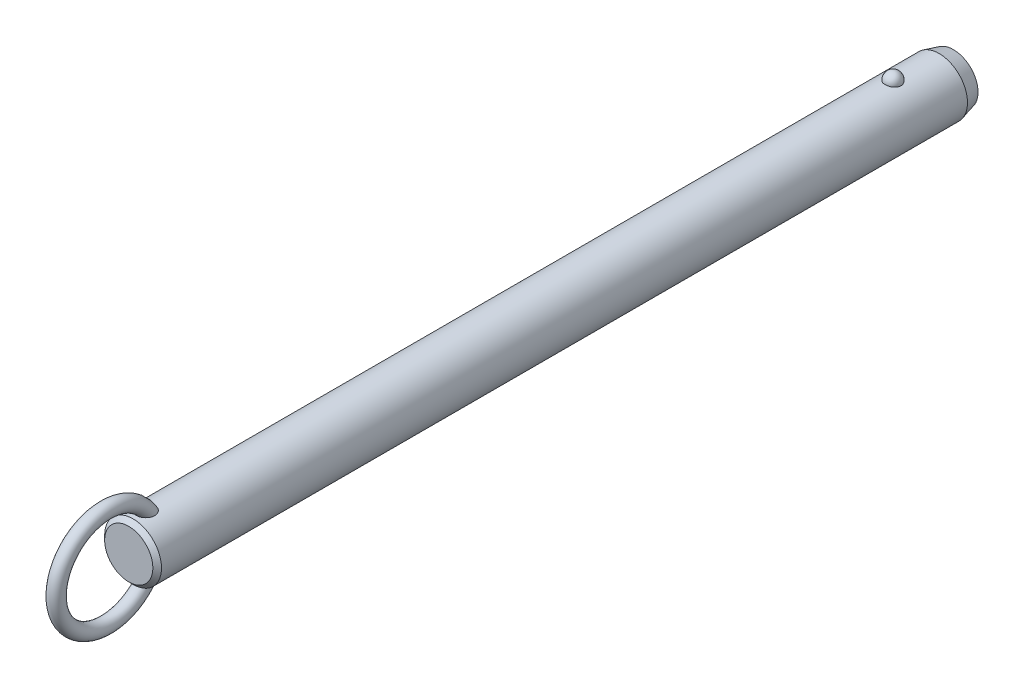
ISO-10303-21;
HEADER;
FILE_DESCRIPTION(('STEP AP214'),'2;1');
FILE_NAME('part.step','',(''),(''),'','','');
FILE_SCHEMA(('AUTOMOTIVE_DESIGN { 1 0 10303 214 1 1 1 1 }'));
ENDSEC;
DATA;
#1=APPLICATION_CONTEXT('core data for automotive mechanical design processes');
#2=APPLICATION_PROTOCOL_DEFINITION('international standard','automotive_design',2000,#1);
#3=PRODUCT_CONTEXT('',#1,'mechanical');
#4=PRODUCT('Part','Part','',(#3));
#5=PRODUCT_RELATED_PRODUCT_CATEGORY('part','',(#4));
#6=PRODUCT_DEFINITION_FORMATION('','',#4);
#7=PRODUCT_DEFINITION_CONTEXT('part definition',#1,'design');
#8=PRODUCT_DEFINITION('design','',#6,#7);
#9=PRODUCT_DEFINITION_SHAPE('','',#8);
#10=(LENGTH_UNIT() NAMED_UNIT(*) SI_UNIT(.MILLI.,.METRE.));
#11=(NAMED_UNIT(*) PLANE_ANGLE_UNIT() SI_UNIT($,.RADIAN.));
#12=(NAMED_UNIT(*) SI_UNIT($,.STERADIAN.) SOLID_ANGLE_UNIT());
#13=UNCERTAINTY_MEASURE_WITH_UNIT(LENGTH_MEASURE(1.E-05),#10,'distance_accuracy_value','');
#14=(GEOMETRIC_REPRESENTATION_CONTEXT(3) GLOBAL_UNCERTAINTY_ASSIGNED_CONTEXT((#13)) GLOBAL_UNIT_ASSIGNED_CONTEXT((#10,
#11,#12)) REPRESENTATION_CONTEXT('',''));
#15=CARTESIAN_POINT('',(0.,0.,0.));
#16=DIRECTION('',(0.,0.,1.));
#17=DIRECTION('',(1.,0.,0.));
#18=AXIS2_PLACEMENT_3D('',#15,#16,#17);
#19=CARTESIAN_POINT('',(0.,0.,200.7));
#20=DIRECTION('',(0.,0.,-1.));
#21=DIRECTION('',(-1.,0.,0.));
#22=AXIS2_PLACEMENT_3D('',#19,#20,#21);
#23=CYLINDRICAL_SURFACE('',#22,7.9);
#24=CARTESIAN_POINT('',(2.1785689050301,7.59367088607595,-2.20000000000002));
#25=CARTESIAN_POINT('',(2.17856679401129,7.59367269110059,-2.07701843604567));
#26=CARTESIAN_POINT('',(2.16853481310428,7.59657145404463,-1.95401006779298));
#27=CARTESIAN_POINT('',(2.12864689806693,7.607843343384,-1.71147811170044));
#28=CARTESIAN_POINT('',(2.09878338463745,7.61621856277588,-1.59195587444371));
#29=CARTESIAN_POINT('',(2.0199931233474,7.63749180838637,-1.35985638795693));
#30=CARTESIAN_POINT('',(1.97107475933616,7.65038784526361,-1.24727610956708));
#31=CARTESIAN_POINT('',(1.85539377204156,7.67926115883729,-1.03213234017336));
#32=CARTESIAN_POINT('',(1.78863158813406,7.69523835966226,-0.929568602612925));
#33=CARTESIAN_POINT('',(1.63856494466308,7.7285848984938,-0.736786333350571));
#34=CARTESIAN_POINT('',(1.55518140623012,7.7459606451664,-0.646630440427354));
#35=CARTESIAN_POINT('',(1.37422937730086,7.78009978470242,-0.481747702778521));
#36=CARTESIAN_POINT('',(1.27666086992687,7.79686317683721,-0.407020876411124));
#37=CARTESIAN_POINT('',(1.07024728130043,7.82786153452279,-0.275278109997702));
#38=CARTESIAN_POINT('',(0.961434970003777,7.84210353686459,-0.218212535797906));
#39=CARTESIAN_POINT('',(0.735351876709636,7.86652194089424,-0.123146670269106));
#40=CARTESIAN_POINT('',(0.618082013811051,7.87669878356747,-0.0851443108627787));
#41=CARTESIAN_POINT('',(0.380637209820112,7.89170521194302,-0.0298158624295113));
#42=CARTESIAN_POINT('',(0.260550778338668,7.89662650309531,-0.0121347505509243));
#43=CARTESIAN_POINT('',(0.019011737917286,7.90090003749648,0.00324379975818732));
#44=CARTESIAN_POINT('',(-0.10244074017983,7.90025280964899,0.000943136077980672));
#45=CARTESIAN_POINT('',(-0.341452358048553,7.89351056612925,-0.0233955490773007));
#46=CARTESIAN_POINT('',(-0.459042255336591,7.88749257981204,-0.0451545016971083));
#47=CARTESIAN_POINT('',(-0.688796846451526,7.87075812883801,-0.107408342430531));
#48=CARTESIAN_POINT('',(-0.800961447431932,7.86004158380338,-0.14790355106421));
#49=CARTESIAN_POINT('',(-1.01743634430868,7.83497131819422,-0.246799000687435));
#50=CARTESIAN_POINT('',(-1.12169791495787,7.82059709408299,-0.305300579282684));
#51=CARTESIAN_POINT('',(-1.31891765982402,7.78976470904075,-0.438549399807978));
#52=CARTESIAN_POINT('',(-1.41187469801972,7.77330633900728,-0.513298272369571));
#53=CARTESIAN_POINT('',(-1.58577142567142,7.73972434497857,-0.678622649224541));
#54=CARTESIAN_POINT('',(-1.66645140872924,7.72259402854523,-0.769470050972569));
#55=CARTESIAN_POINT('',(-1.81161503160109,7.68983776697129,-0.963538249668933));
#56=CARTESIAN_POINT('',(-1.87609753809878,7.6742119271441,-1.0667599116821));
#57=CARTESIAN_POINT('',(-1.98790138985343,7.6460202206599,-1.28401170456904));
#58=CARTESIAN_POINT('',(-2.03501994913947,7.63349104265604,-1.39815107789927));
#59=CARTESIAN_POINT('',(-2.10986724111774,7.6131449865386,-1.6330178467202));
#60=CARTESIAN_POINT('',(-2.1375965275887,7.60532797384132,-1.75374505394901));
#61=CARTESIAN_POINT('',(-2.17289256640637,7.5953195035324,-1.99782562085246));
#62=CARTESIAN_POINT('',(-2.18054294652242,7.59310471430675,-2.12116592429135));
#63=CARTESIAN_POINT('',(-2.17572919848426,7.59448538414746,-2.36741799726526));
#64=CARTESIAN_POINT('',(-2.1632656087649,7.59808068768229,-2.49032977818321));
#65=CARTESIAN_POINT('',(-2.11865035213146,7.61064035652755,-2.73161015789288));
#66=CARTESIAN_POINT('',(-2.08659579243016,7.61957823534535,-2.84999812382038));
#67=CARTESIAN_POINT('',(-2.00367799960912,7.64179982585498,-3.07955956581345));
#68=CARTESIAN_POINT('',(-1.9528140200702,7.65508371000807,-3.19073275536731));
#69=CARTESIAN_POINT('',(-1.83321113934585,7.68460381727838,-3.40337899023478));
#70=CARTESIAN_POINT('',(-1.76437735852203,7.70085556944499,-3.5047965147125));
#71=CARTESIAN_POINT('',(-1.61069526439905,7.73445734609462,-3.69446912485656));
#72=CARTESIAN_POINT('',(-1.52584634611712,7.75180741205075,-3.78272371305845));
#73=CARTESIAN_POINT('',(-1.34198059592,7.78574608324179,-3.94393987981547));
#74=CARTESIAN_POINT('',(-1.24291308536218,7.80233167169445,-4.01684434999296));
#75=CARTESIAN_POINT('',(-1.03352039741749,7.83281625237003,-4.14489386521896));
#76=CARTESIAN_POINT('',(-0.923196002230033,7.84671543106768,-4.20004014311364));
#77=CARTESIAN_POINT('',(-0.69582211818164,7.87011575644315,-4.29042017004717));
#78=CARTESIAN_POINT('',(-0.578872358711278,7.87966903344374,-4.32589112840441));
#79=CARTESIAN_POINT('',(-0.34041023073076,7.8935652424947,-4.37692226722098));
#80=CARTESIAN_POINT('',(-0.218898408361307,7.89790879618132,-4.39248482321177));
#81=CARTESIAN_POINT('',(0.0228107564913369,7.90087453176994,-4.40314405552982));
#82=CARTESIAN_POINT('',(0.142990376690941,7.89960185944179,-4.39861683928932));
#83=CARTESIAN_POINT('',(0.380829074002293,7.89171262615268,-4.37008293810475));
#84=CARTESIAN_POINT('',(0.498488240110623,7.8850962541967,-4.34607694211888));
#85=CARTESIAN_POINT('',(0.727535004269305,7.86726442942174,-4.27939317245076));
#86=CARTESIAN_POINT('',(0.838944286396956,7.85606616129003,-4.23678512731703));
#87=CARTESIAN_POINT('',(1.05295421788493,7.83025654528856,-4.13408348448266));
#88=CARTESIAN_POINT('',(1.15555431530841,7.81564498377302,-4.07398879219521));
#89=CARTESIAN_POINT('',(1.35076763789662,7.7843022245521,-3.93687432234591));
#90=CARTESIAN_POINT('',(1.4432046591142,7.76754209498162,-3.85961036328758));
#91=CARTESIAN_POINT('',(1.6139111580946,7.73387857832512,-3.69076949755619));
#92=CARTESIAN_POINT('',(1.6921781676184,7.71697516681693,-3.59919010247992));
#93=CARTESIAN_POINT('',(1.83380875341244,7.6845643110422,-3.40247278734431));
#94=CARTESIAN_POINT('',(1.89689280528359,7.66908588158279,-3.29712873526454));
#95=CARTESIAN_POINT('',(2.0047823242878,7.64159441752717,-3.077079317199));
#96=CARTESIAN_POINT('',(2.0495945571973,7.62958010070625,-2.96237743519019));
#97=CARTESIAN_POINT('',(2.11580183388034,7.61146617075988,-2.74040519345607));
#98=CARTESIAN_POINT('',(2.13929812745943,7.60484503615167,-2.63379846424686));
#99=CARTESIAN_POINT('',(2.17068242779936,7.59594664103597,-2.4181348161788));
#100=CARTESIAN_POINT('',(2.17857077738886,7.59366928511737,-2.30907795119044));
#101=CARTESIAN_POINT('',(2.1785689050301,7.59367088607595,-2.20000000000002));
#102=B_SPLINE_CURVE_WITH_KNOTS('',3,(#24,#25,#26,#27,#28,#29,#30,#31,#32,#33,#34,#35,#36,#37,
#38,#39,#40,#41,#42,#43,#44,#45,#46,#47,#48,#49,#50,#51,#52,#53,#54,#55,#56,#57,#58,#59,#60,#61,
#62,#63,#64,#65,#66,#67,#68,#69,#70,#71,#72,#73,#74,#75,#76,#77,#78,#79,#80,#81,#82,#83,#84,#85,
#86,#87,#88,#89,#90,#91,#92,#93,#94,#95,#96,#97,#98,#99,#100,#101),.UNSPECIFIED.,.T.,.F.,(4,2,2,
2,2,2,2,2,2,2,2,2,2,2,2,2,2,2,2,2,2,2,2,2,2,2,2,2,2,2,2,2,2,2,2,2,2,2,4),(0.,0.368552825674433,
0.737246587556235,1.10577831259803,1.4743009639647,1.84462067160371,2.21494081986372,
2.58421058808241,2.95344028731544,3.31611630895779,3.67875788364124,4.03628044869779,
4.39380913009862,4.75338791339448,5.11300280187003,5.47939989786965,5.8458226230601,
6.21639834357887,6.58696347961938,6.95598276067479,7.32499216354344,7.69218715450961,
8.0593967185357,8.42858578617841,8.79778880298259,9.16834203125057,9.5388695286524,
9.90482699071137,10.2707407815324,10.6298333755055,10.9889132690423,11.3466585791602,
11.7044262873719,12.0676511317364,12.4309391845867,12.8004764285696,13.1698767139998,
13.4967701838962,13.8236564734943),.UNSPECIFIED.);
#103=CARTESIAN_POINT('',(2.1785689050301,7.59367088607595,-2.20000000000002));
#104=VERTEX_POINT('',#103);
#105=EDGE_CURVE('E41',#104,#104,#102,.T.);
#106=ORIENTED_EDGE('',*,*,#105,.T.);
#107=EDGE_LOOP('',(#106));
#108=FACE_BOUND('',#107,.T.);
#109=CARTESIAN_POINT('',(0.,0.,209.02));
#110=DIRECTION('',(0.,0.,1.));
#111=DIRECTION('',(1.,0.,0.));
#112=AXIS2_PLACEMENT_3D('',#109,#110,#111);
#113=CIRCLE('',#112,7.9);
#114=CARTESIAN_POINT('',(7.9,0.,209.02));
#115=VERTEX_POINT('',#114);
#116=EDGE_CURVE('E10',#115,#115,#113,.F.);
#117=ORIENTED_EDGE('',*,*,#116,.T.);
#118=EDGE_LOOP('',(#117));
#119=FACE_BOUND('',#118,.T.);
#120=CARTESIAN_POINT('',(-0.630969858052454,-7.87476203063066,202.912432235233));
#121=CARTESIAN_POINT('',(-0.734180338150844,-7.86648998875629,202.947285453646));
#122=CARTESIAN_POINT('',(-0.83447695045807,-7.85639291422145,202.990816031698));
#123=CARTESIAN_POINT('',(-1.0262035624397,-7.83366343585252,203.094094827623));
#124=CARTESIAN_POINT('',(-1.1176141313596,-7.82102565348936,203.153877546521));
#125=CARTESIAN_POINT('',(-1.28877277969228,-7.79464922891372,203.287839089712));
#126=CARTESIAN_POINT('',(-1.36854014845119,-7.7809124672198,203.361993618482));
#127=CARTESIAN_POINT('',(-1.51461521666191,-7.75380398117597,203.522494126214));
#128=CARTESIAN_POINT('',(-1.58092966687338,-7.74043207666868,203.608833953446));
#129=CARTESIAN_POINT('',(-1.70019064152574,-7.7151252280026,203.792978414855));
#130=CARTESIAN_POINT('',(-1.75284037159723,-7.70322473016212,203.890979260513));
#131=CARTESIAN_POINT('',(-1.84263464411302,-7.68224112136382,204.094102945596));
#132=CARTESIAN_POINT('',(-1.87977299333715,-7.6731591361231,204.199228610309));
#133=CARTESIAN_POINT('',(-1.94152728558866,-7.65777930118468,204.423284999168));
#134=CARTESIAN_POINT('',(-1.96475471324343,-7.65179654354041,204.542616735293));
#135=CARTESIAN_POINT('',(-1.99449499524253,-7.64409642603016,204.78342986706));
#136=CARTESIAN_POINT('',(-2.0010005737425,-7.64238092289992,204.904912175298));
#137=CARTESIAN_POINT('',(-1.99856014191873,-7.64302120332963,205.168340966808));
#138=CARTESIAN_POINT('',(-1.98680021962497,-7.64611845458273,205.31025654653));
#139=CARTESIAN_POINT('',(-1.94457772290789,-7.65696186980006,205.591118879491));
#140=CARTESIAN_POINT('',(-1.91409393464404,-7.66471330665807,205.730062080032));
#141=CARTESIAN_POINT('',(-1.82768670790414,-7.68582947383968,206.031939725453));
#142=CARTESIAN_POINT('',(-1.76772963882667,-7.70003779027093,206.193686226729));
#143=CARTESIAN_POINT('',(-1.65998501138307,-7.72371550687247,206.427695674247));
#144=CARTESIAN_POINT('',(-1.621079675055,-7.73200670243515,206.504297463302));
#145=CARTESIAN_POINT('',(-1.53727726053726,-7.7491037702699,206.654079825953));
#146=CARTESIAN_POINT('',(-1.49238215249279,-7.75790947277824,206.727261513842));
#147=CARTESIAN_POINT('',(-1.37397050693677,-7.77993338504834,206.90288382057));
#148=CARTESIAN_POINT('',(-1.29690364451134,-7.79328473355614,207.002955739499));
#149=CARTESIAN_POINT('',(-1.12885487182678,-7.81939266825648,207.190714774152));
#150=CARTESIAN_POINT('',(-1.03789926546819,-7.83215032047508,207.278424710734));
#151=CARTESIAN_POINT('',(-0.869532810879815,-7.85231710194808,207.413414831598));
#152=CARTESIAN_POINT('',(-0.795716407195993,-7.86021093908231,207.465076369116));
#153=CARTESIAN_POINT('',(-0.640813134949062,-7.87434920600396,207.556381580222));
#154=CARTESIAN_POINT('',(-0.559737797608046,-7.88059619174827,207.59604389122));
#155=CARTESIAN_POINT('',(-0.40645605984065,-7.88984116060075,207.654300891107));
#156=CARTESIAN_POINT('',(-0.335227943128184,-7.89321892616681,207.675384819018));
#157=CARTESIAN_POINT('',(-0.190193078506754,-7.89804235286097,207.70541418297));
#158=CARTESIAN_POINT('',(-0.116388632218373,-7.89948969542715,207.714370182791));
#159=CARTESIAN_POINT('',(0.0318414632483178,-7.90028409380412,207.719291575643));
#160=CARTESIAN_POINT('',(0.106268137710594,-7.89962640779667,207.715227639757));
#161=CARTESIAN_POINT('',(0.253290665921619,-7.8962818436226,207.694461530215));
#162=CARTESIAN_POINT('',(0.325885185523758,-7.8935935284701,207.677750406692));
#163=CARTESIAN_POINT('',(0.481441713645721,-7.88577340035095,207.628738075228));
#164=CARTESIAN_POINT('',(0.563611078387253,-7.88026321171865,207.594005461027));
#165=CARTESIAN_POINT('',(0.721129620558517,-7.86741729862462,207.511796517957));
#166=CARTESIAN_POINT('',(0.796466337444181,-7.86007832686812,207.464297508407));
#167=CARTESIAN_POINT('',(0.971456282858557,-7.84073285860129,207.336513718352));
#168=CARTESIAN_POINT('',(1.06719686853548,-7.82809461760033,207.251004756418));
#169=CARTESIAN_POINT('',(1.24418921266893,-7.80192439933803,207.066232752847));
#170=CARTESIAN_POINT('',(1.32540832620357,-7.78839049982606,206.966939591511));
#171=CARTESIAN_POINT('',(1.45199971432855,-7.76559693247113,206.789576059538));
#172=CARTESIAN_POINT('',(1.50085649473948,-7.75626094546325,206.713954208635));
#173=CARTESIAN_POINT('',(1.59197749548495,-7.7380727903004,206.558742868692));
#174=CARTESIAN_POINT('',(1.63423919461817,-7.72922080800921,206.479151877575));
#175=CARTESIAN_POINT('',(1.71222612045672,-7.71231959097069,206.316664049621));
#176=CARTESIAN_POINT('',(1.74794516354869,-7.70427111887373,206.233764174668));
#177=CARTESIAN_POINT('',(1.81270113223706,-7.68929240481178,206.065296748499));
#178=CARTESIAN_POINT('',(1.84173789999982,-7.68236218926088,205.979729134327));
#179=CARTESIAN_POINT('',(1.89322698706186,-7.6698375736,205.80528702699));
#180=CARTESIAN_POINT('',(1.91558744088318,-7.66426199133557,205.716383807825));
#181=CARTESIAN_POINT('',(1.95281367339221,-7.65485915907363,205.536969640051));
#182=CARTESIAN_POINT('',(1.96767946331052,-7.65103190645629,205.446458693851));
#183=CARTESIAN_POINT('',(2.00021456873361,-7.64262981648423,205.173732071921));
#184=CARTESIAN_POINT('',(2.00600691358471,-7.6410871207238,204.989709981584));
#185=CARTESIAN_POINT('',(1.98445334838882,-7.64669564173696,204.676501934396));
#186=CARTESIAN_POINT('',(1.96607186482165,-7.65149688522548,204.546618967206));
#187=CARTESIAN_POINT('',(1.90884967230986,-7.6659762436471,204.291632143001));
#188=CARTESIAN_POINT('',(1.87002101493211,-7.67565148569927,204.166525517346));
#189=CARTESIAN_POINT('',(1.77063986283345,-7.69918471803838,203.92454013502));
#190=CARTESIAN_POINT('',(1.7099372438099,-7.71307150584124,203.807725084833));
#191=CARTESIAN_POINT('',(1.56733070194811,-7.74330306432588,203.588144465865));
#192=CARTESIAN_POINT('',(1.48543692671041,-7.75964665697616,203.485372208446));
#193=CARTESIAN_POINT('',(1.31346177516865,-7.79047523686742,203.309380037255));
#194=CARTESIAN_POINT('',(1.22547278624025,-7.80495298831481,203.234106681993));
#195=CARTESIAN_POINT('',(1.03724352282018,-7.83218597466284,203.100486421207));
#196=CARTESIAN_POINT('',(0.937008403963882,-7.84494192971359,203.042132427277));
#197=CARTESIAN_POINT('',(0.733599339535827,-7.86649045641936,202.947027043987));
#198=CARTESIAN_POINT('',(0.630941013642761,-7.87547134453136,202.909210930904));
#199=CARTESIAN_POINT('',(0.42046522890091,-7.88950708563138,202.851116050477));
#200=CARTESIAN_POINT('',(0.312645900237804,-7.89456050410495,202.83084369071));
#201=CARTESIAN_POINT('',(0.0960869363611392,-7.9001518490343,202.808455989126));
#202=CARTESIAN_POINT('',(-0.0126341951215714,-7.90073226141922,202.806169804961));
#203=CARTESIAN_POINT('',(-0.228766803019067,-7.89742350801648,202.819367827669));
#204=CARTESIAN_POINT('',(-0.336180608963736,-7.89354403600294,202.834813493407));
#205=CARTESIAN_POINT('',(-0.473410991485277,-7.88586871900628,202.866217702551));
#206=CARTESIAN_POINT('',(-0.505257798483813,-7.88388984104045,202.874354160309));
#207=CARTESIAN_POINT('',(-0.568481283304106,-7.87958326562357,202.892208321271));
#208=CARTESIAN_POINT('',(-0.599857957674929,-7.87725556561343,202.901926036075));
#209=CARTESIAN_POINT('',(-0.630969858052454,-7.87476203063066,202.912432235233));
#210=B_SPLINE_CURVE_WITH_KNOTS('',3,(#120,#121,#122,#123,#124,#125,#126,#127,#128,#129,#130,
#131,#132,#133,#134,#135,#136,#137,#138,#139,#140,#141,#142,#143,#144,#145,#146,#147,#148,#149,
#150,#151,#152,#153,#154,#155,#156,#157,#158,#159,#160,#161,#162,#163,#164,#165,#166,#167,#168,
#169,#170,#171,#172,#173,#174,#175,#176,#177,#178,#179,#180,#181,#182,#183,#184,#185,#186,#187,
#188,#189,#190,#191,#192,#193,#194,#195,#196,#197,#198,#199,#200,#201,#202,#203,#204,#205,#206,
#207,#208,#209),.UNSPECIFIED.,.T.,.F.,(4,2,2,2,2,2,2,2,2,2,2,2,2,2,2,2,2,2,2,2,2,2,2,2,2,2,2,2,
2,2,2,2,2,2,2,2,2,2,2,2,2,2,2,2,4),(0.,0.327622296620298,0.655945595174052,0.983718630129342,
1.3113267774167,1.64554655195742,1.97989964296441,2.34365728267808,2.70757317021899,
3.13333684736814,3.5595838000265,4.07655306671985,4.33527897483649,4.59391999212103,
4.97382437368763,5.353017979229,5.62348245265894,5.89352465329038,6.11565959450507,
6.33760092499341,6.56004255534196,6.78264174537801,7.04930844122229,7.31645206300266,
7.70130871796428,8.08701995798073,8.35824509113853,8.62957365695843,8.9011573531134,
9.1727474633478,9.44791855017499,9.72308922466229,10.2715298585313,10.6638393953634,
11.0559179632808,11.4507403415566,11.8453740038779,12.1936425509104,12.5417649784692,
12.8695063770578,13.1973674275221,13.5221104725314,13.8461490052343,13.9449071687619,
14.0436660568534),.UNSPECIFIED.);
#211=CARTESIAN_POINT('',(-0.630969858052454,-7.87476203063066,202.912432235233));
#212=VERTEX_POINT('',#211);
#213=EDGE_CURVE('E60',#212,#212,#210,.T.);
#214=ORIENTED_EDGE('',*,*,#213,.T.);
#215=EDGE_LOOP('',(#214));
#216=FACE_BOUND('',#215,.T.);
#217=CARTESIAN_POINT('',(-0.630969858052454,7.87476203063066,202.912432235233));
#218=CARTESIAN_POINT('',(-0.528918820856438,7.8829363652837,202.877979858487));
#219=CARTESIAN_POINT('',(-0.423745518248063,7.88934810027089,202.851915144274));
#220=CARTESIAN_POINT('',(-0.21023608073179,7.8979273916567,202.817282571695));
#221=CARTESIAN_POINT('',(-0.101893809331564,7.90008607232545,202.808751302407));
#222=CARTESIAN_POINT('',(0.114660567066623,7.89990877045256,202.809457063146));
#223=CARTESIAN_POINT('',(0.222872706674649,7.89757640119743,202.81867980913));
#224=CARTESIAN_POINT('',(0.43610726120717,7.88867538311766,202.854652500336));
#225=CARTESIAN_POINT('',(0.541131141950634,7.8821087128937,202.88139425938));
#226=CARTESIAN_POINT('',(0.745085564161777,7.86545130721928,202.951756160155));
#227=CARTESIAN_POINT('',(0.844015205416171,7.85536005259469,202.995378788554));
#228=CARTESIAN_POINT('',(1.0329916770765,7.83275153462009,203.098379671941));
#229=CARTESIAN_POINT('',(1.12303841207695,7.8202342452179,203.157758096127));
#230=CARTESIAN_POINT('',(1.29214734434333,7.79408219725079,203.290864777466));
#231=CARTESIAN_POINT('',(1.37116907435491,7.78044359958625,203.364643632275));
#232=CARTESIAN_POINT('',(1.51597677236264,7.75353170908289,203.524235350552));
#233=CARTESIAN_POINT('',(1.58176261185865,7.74025841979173,203.610048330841));
#234=CARTESIAN_POINT('',(1.70057386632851,7.71504069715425,203.793644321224));
#235=CARTESIAN_POINT('',(1.75320073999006,7.7031425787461,203.891690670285));
#236=CARTESIAN_POINT('',(1.84293767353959,7.68216822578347,204.094893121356));
#237=CARTESIAN_POINT('',(1.88004278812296,7.67309289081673,204.200051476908));
#238=CARTESIAN_POINT('',(1.94172327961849,7.6577294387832,204.424167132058));
#239=CARTESIAN_POINT('',(1.96491037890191,7.65175648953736,204.543524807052));
#240=CARTESIAN_POINT('',(1.9945689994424,7.64407702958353,204.784384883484));
#241=CARTESIAN_POINT('',(2.00103304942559,7.64237242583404,204.90588821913));
#242=CARTESIAN_POINT('',(1.99850166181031,7.64303650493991,205.169368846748));
#243=CARTESIAN_POINT('',(1.98669038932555,7.64614714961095,205.311314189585));
#244=CARTESIAN_POINT('',(1.94436120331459,7.65701701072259,205.592228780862));
#245=CARTESIAN_POINT('',(1.91382203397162,7.66478150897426,205.731194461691));
#246=CARTESIAN_POINT('',(1.82728754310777,7.68592483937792,206.033111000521));
#247=CARTESIAN_POINT('',(1.7672577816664,7.7001468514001,206.194872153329));
#248=CARTESIAN_POINT('',(1.65939700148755,7.72384204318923,206.428891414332));
#249=CARTESIAN_POINT('',(1.62045187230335,7.73213852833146,206.505494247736));
#250=CARTESIAN_POINT('',(1.53656684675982,7.74924489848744,206.655273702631));
#251=CARTESIAN_POINT('',(1.49162892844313,7.75805461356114,206.728451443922));
#252=CARTESIAN_POINT('',(1.37317698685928,7.78007342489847,206.903952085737));
#253=CARTESIAN_POINT('',(1.29612360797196,7.79341423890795,207.003911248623));
#254=CARTESIAN_POINT('',(1.12812043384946,7.81949839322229,207.19145083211));
#255=CARTESIAN_POINT('',(1.0371968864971,7.83224280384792,207.279054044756));
#256=CARTESIAN_POINT('',(0.868871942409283,7.85239026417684,207.41389715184));
#257=CARTESIAN_POINT('',(0.795056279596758,7.86027769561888,207.465511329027));
#258=CARTESIAN_POINT('',(0.640160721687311,7.87440222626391,207.556720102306));
#259=CARTESIAN_POINT('',(0.559092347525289,7.88064188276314,207.596333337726));
#260=CARTESIAN_POINT('',(0.405820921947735,7.8898738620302,207.654505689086));
#261=CARTESIAN_POINT('',(0.334594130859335,7.89324577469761,207.675552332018));
#262=CARTESIAN_POINT('',(0.189568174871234,7.89805733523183,207.705507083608));
#263=CARTESIAN_POINT('',(0.115771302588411,7.89949866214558,207.714425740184));
#264=CARTESIAN_POINT('',(-0.0324359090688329,7.90028156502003,207.71927589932));
#265=CARTESIAN_POINT('',(-0.106847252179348,7.89961843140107,207.715178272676));
#266=CARTESIAN_POINT('',(-0.25383438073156,7.8962642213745,207.694351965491));
#267=CARTESIAN_POINT('',(-0.326408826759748,7.89357170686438,207.677614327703));
#268=CARTESIAN_POINT('',(-0.481962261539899,7.88574179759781,207.628539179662));
#269=CARTESIAN_POINT('',(-0.564145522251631,7.88022507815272,207.593763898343));
#270=CARTESIAN_POINT('',(-0.721685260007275,7.86736646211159,207.511468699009));
#271=CARTESIAN_POINT('',(-0.797029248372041,7.8600213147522,207.463926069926));
#272=CARTESIAN_POINT('',(-0.972044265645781,7.84066026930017,207.336026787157));
#273=CARTESIAN_POINT('',(-1.06779803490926,7.82801274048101,207.250443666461));
#274=CARTESIAN_POINT('',(-1.24480531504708,7.80182621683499,207.065522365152));
#275=CARTESIAN_POINT('',(-1.32602618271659,7.78828530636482,206.966154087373));
#276=CARTESIAN_POINT('',(-1.45259834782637,7.76548487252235,206.788680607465));
#277=CARTESIAN_POINT('',(-1.50143856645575,7.75614818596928,206.713025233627));
#278=CARTESIAN_POINT('',(-1.59252410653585,7.73796020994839,206.557748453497));
#279=CARTESIAN_POINT('',(-1.63476690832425,7.72910910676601,206.478125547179));
#280=CARTESIAN_POINT('',(-1.71271318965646,7.71221133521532,206.315575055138));
#281=CARTESIAN_POINT('',(-1.7484104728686,7.70416543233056,206.232644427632));
#282=CARTESIAN_POINT('',(-1.81311929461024,7.6891937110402,206.064116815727));
#283=CARTESIAN_POINT('',(-1.84213067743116,7.6822679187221,205.978519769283));
#284=CARTESIAN_POINT('',(-1.89356259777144,7.66975461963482,205.804025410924));
#285=CARTESIAN_POINT('',(-1.91589165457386,7.66418586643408,205.715099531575));
#286=CARTESIAN_POINT('',(-1.95305070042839,7.65479859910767,205.535642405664));
#287=CARTESIAN_POINT('',(-1.96788069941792,7.65098008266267,205.445111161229));
#288=CARTESIAN_POINT('',(-2.00030078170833,7.64260704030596,205.172327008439));
#289=CARTESIAN_POINT('',(-2.00600576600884,7.64108760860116,204.988271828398));
#290=CARTESIAN_POINT('',(-1.98428483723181,7.64673945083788,204.675080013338));
#291=CARTESIAN_POINT('',(-1.96583698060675,7.6515575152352,204.545240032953));
#292=CARTESIAN_POINT('',(-1.90848948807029,7.66606613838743,204.290361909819));
#293=CARTESIAN_POINT('',(-1.86960376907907,7.67575338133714,204.165320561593));
#294=CARTESIAN_POINT('',(-1.77013421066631,7.69930132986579,203.923500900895));
#295=CARTESIAN_POINT('',(-1.70940488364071,7.71318991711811,203.806784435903));
#296=CARTESIAN_POINT('',(-1.56672953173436,7.74342495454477,203.587340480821));
#297=CARTESIAN_POINT('',(-1.48478316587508,7.75977144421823,203.48461321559));
#298=CARTESIAN_POINT('',(-1.31266325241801,7.7906116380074,203.308643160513));
#299=CARTESIAN_POINT('',(-1.2245638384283,7.80509908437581,203.233358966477));
#300=CARTESIAN_POINT('',(-1.03622400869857,7.83231881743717,203.099865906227));
#301=CARTESIAN_POINT('',(-0.936015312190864,7.84505551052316,203.041613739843));
#302=CARTESIAN_POINT('',(-0.798824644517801,7.85957802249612,202.977540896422));
#303=CARTESIAN_POINT('',(-0.765787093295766,7.86286821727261,202.963224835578));
#304=CARTESIAN_POINT('',(-0.698939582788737,7.86909211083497,202.936436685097));
#305=CARTESIAN_POINT('',(-0.665129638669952,7.87202581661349,202.923964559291));
#306=CARTESIAN_POINT('',(-0.630969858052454,7.87476203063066,202.912432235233));
#307=B_SPLINE_CURVE_WITH_KNOTS('',3,(#217,#218,#219,#220,#221,#222,#223,#224,#225,#226,#227,
#228,#229,#230,#231,#232,#233,#234,#235,#236,#237,#238,#239,#240,#241,#242,#243,#244,#245,#246,
#247,#248,#249,#250,#251,#252,#253,#254,#255,#256,#257,#258,#259,#260,#261,#262,#263,#264,#265,
#266,#267,#268,#269,#270,#271,#272,#273,#274,#275,#276,#277,#278,#279,#280,#281,#282,#283,#284,
#285,#286,#287,#288,#289,#290,#291,#292,#293,#294,#295,#296,#297,#298,#299,#300,#301,#302,#303,
#304,#305,#306),.UNSPECIFIED.,.T.,.F.,(4,2,2,2,2,2,2,2,2,2,2,2,2,2,2,2,2,2,2,2,2,2,2,2,2,2,2,2,
2,2,2,2,2,2,2,2,2,2,2,2,2,2,2,2,4),(0.,0.323920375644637,0.648516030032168,0.972850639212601,
1.29703380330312,1.62126473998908,1.94549915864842,2.27089401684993,2.59629203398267,
2.93059633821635,3.26500707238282,3.62881644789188,3.99278833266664,4.41865421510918,
4.84500434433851,5.36209210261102,5.62087589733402,5.87957448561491,6.2591859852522,
6.6380878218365,6.90846748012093,7.17842501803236,7.40052350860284,7.62242871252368,
7.84483086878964,8.06739077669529,8.33414615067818,8.60137921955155,8.98641454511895,
9.3723041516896,9.64358673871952,9.91497268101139,10.1866142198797,10.4582620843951,
10.7334745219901,11.0086865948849,11.5572126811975,11.9494246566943,12.3413699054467,
12.7359755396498,13.1305875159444,13.4791770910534,13.82687259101,13.9353013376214,
14.0437279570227),.UNSPECIFIED.);
#308=CARTESIAN_POINT('',(-0.630969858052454,7.87476203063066,202.912432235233));
#309=VERTEX_POINT('',#308);
#310=EDGE_CURVE('E68',#309,#309,#307,.T.);
#311=ORIENTED_EDGE('',*,*,#310,.T.);
#312=EDGE_LOOP('',(#311));
#313=FACE_BOUND('',#312,.T.);
#314=CARTESIAN_POINT('',(0.,0.,-15.0000000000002));
#315=DIRECTION('',(0.,0.,-1.));
#316=DIRECTION('',(-1.,0.,0.));
#317=AXIS2_PLACEMENT_3D('',#314,#315,#316);
#318=CIRCLE('',#317,7.9);
#319=CARTESIAN_POINT('',(-7.9,0.,-15.0000000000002));
#320=VERTEX_POINT('',#319);
#321=EDGE_CURVE('E57',#320,#320,#318,.F.);
#322=ORIENTED_EDGE('',*,*,#321,.T.);
#323=EDGE_LOOP('',(#322));
#324=FACE_BOUND('',#323,.T.);
#325=ADVANCED_FACE('F37',(#108,#119,#216,#313,#324),#23,.T.);
#326=CARTESIAN_POINT('',(0.,0.,-19.));
#327=DIRECTION('',(0.,0.,-1.));
#328=DIRECTION('',(-1.,0.,0.));
#329=AXIS2_PLACEMENT_3D('',#326,#327,#328);
#330=PLANE('',#329);
#331=CARTESIAN_POINT('',(0.,0.,-19.));
#332=DIRECTION('',(0.,0.,-1.));
#333=DIRECTION('',(-1.,0.,0.));
#334=AXIS2_PLACEMENT_3D('',#331,#332,#333);
#335=CIRCLE('',#334,6.82820323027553);
#336=CARTESIAN_POINT('',(-6.82820323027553,0.,-19.));
#337=VERTEX_POINT('',#336);
#338=EDGE_CURVE('E67',#337,#337,#335,.T.);
#339=ORIENTED_EDGE('',*,*,#338,.T.);
#340=EDGE_LOOP('',(#339));
#341=FACE_BOUND('',#340,.T.);
#342=ADVANCED_FACE('F86',(#341),#330,.T.);
#343=CARTESIAN_POINT('',(0.,0.,-19.));
#344=DIRECTION('',(0.,0.,1.));
#345=DIRECTION('',(1.,0.,0.));
#346=AXIS2_PLACEMENT_3D('',#343,#344,#345);
#347=CONICAL_SURFACE('',#346,6.82820323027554,0.261799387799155);
#348=ORIENTED_EDGE('',*,*,#321,.F.);
#349=EDGE_LOOP('',(#348));
#350=FACE_BOUND('',#349,.T.);
#351=ORIENTED_EDGE('',*,*,#338,.F.);
#352=EDGE_LOOP('',(#351));
#353=FACE_BOUND('',#352,.T.);
#354=ADVANCED_FACE('F84',(#350,#353),#347,.T.);
#355=CARTESIAN_POINT('',(0.,0.,210.22));
#356=DIRECTION('',(0.,0.,1.));
#357=DIRECTION('',(1.,0.,0.));
#358=AXIS2_PLACEMENT_3D('',#355,#356,#357);
#359=PLANE('',#358);
#360=CARTESIAN_POINT('',(0.,0.,210.22));
#361=DIRECTION('',(0.,0.,1.));
#362=DIRECTION('',(1.,0.,0.));
#363=AXIS2_PLACEMENT_3D('',#360,#361,#362);
#364=CIRCLE('',#363,6.7000000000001);
#365=CARTESIAN_POINT('',(6.7000000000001,0.,210.22));
#366=VERTEX_POINT('',#365);
#367=EDGE_CURVE('E50',#366,#366,#364,.T.);
#368=ORIENTED_EDGE('',*,*,#367,.T.);
#369=EDGE_LOOP('',(#368));
#370=FACE_BOUND('',#369,.T.);
#371=ADVANCED_FACE('F78',(#370),#359,.T.);
#372=CARTESIAN_POINT('',(0.,0.,216.55));
#373=DIRECTION('',(1.,0.,0.));
#374=DIRECTION('',(0.,0.,-1.));
#375=AXIS2_PLACEMENT_3D('',#372,#373,#374);
#376=TOROIDAL_SURFACE('',#375,13.85,2.);
#377=ORIENTED_EDGE('',*,*,#310,.F.);
#378=EDGE_LOOP('',(#377));
#379=FACE_BOUND('',#378,.T.);
#380=ORIENTED_EDGE('',*,*,#213,.F.);
#381=EDGE_LOOP('',(#380));
#382=FACE_BOUND('',#381,.T.);
#383=ADVANCED_FACE('F74',(#379,#382),#376,.T.);
#384=CARTESIAN_POINT('',(0.,0.,210.22));
#385=DIRECTION('',(0.,0.,-1.));
#386=DIRECTION('',(-1.,0.,0.));
#387=AXIS2_PLACEMENT_3D('',#384,#385,#386);
#388=CONICAL_SURFACE('',#387,6.7000000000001,0.785398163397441);
#389=ORIENTED_EDGE('',*,*,#116,.F.);
#390=EDGE_LOOP('',(#389));
#391=FACE_BOUND('',#390,.T.);
#392=ORIENTED_EDGE('',*,*,#367,.F.);
#393=EDGE_LOOP('',(#392));
#394=FACE_BOUND('',#393,.T.);
#395=ADVANCED_FACE('F39',(#391,#394),#388,.T.);
#396=CARTESIAN_POINT('',(0.,7.9,-2.20000000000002));
#397=DIRECTION('',(0.,1.,0.));
#398=DIRECTION('',(0.,0.,1.));
#399=AXIS2_PLACEMENT_3D('',#396,#397,#398);
#400=SPHERICAL_SURFACE('',#399,2.2);
#401=ORIENTED_EDGE('',*,*,#105,.F.);
#402=EDGE_LOOP('',(#401));
#403=FACE_BOUND('',#402,.T.);
#404=ADVANCED_FACE('F80',(#403),#400,.T.);
#405=CLOSED_SHELL('',(#325,#342,#354,#371,#383,#395,#404));
#406=MANIFOLD_SOLID_BREP('B2',#405);
#407=ADVANCED_BREP_SHAPE_REPRESENTATION('',(#18,#406),#14);
#408=SHAPE_DEFINITION_REPRESENTATION(#9,#407);
ENDSEC;
END-ISO-10303-21;
